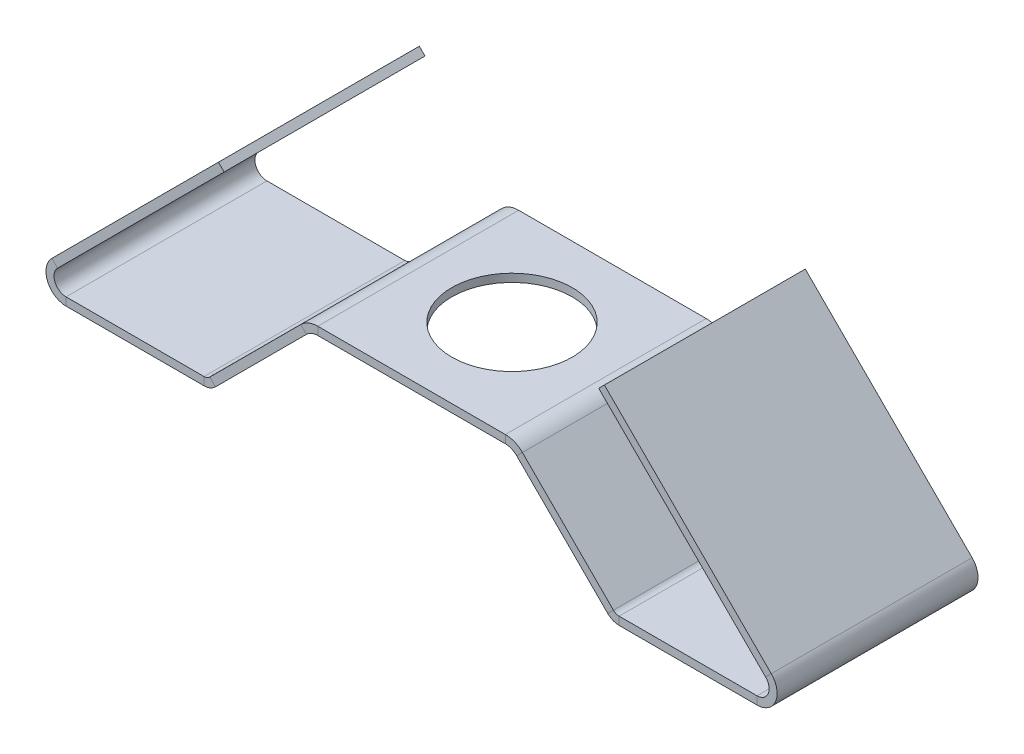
ISO-10303-21;
HEADER;
FILE_DESCRIPTION(('STEP AP214'),'2;1');
FILE_NAME('part.step','',(''),(''),'','','');
FILE_SCHEMA(('AUTOMOTIVE_DESIGN { 1 0 10303 214 1 1 1 1 }'));
ENDSEC;
DATA;
#1=APPLICATION_CONTEXT('core data for automotive mechanical design processes');
#2=APPLICATION_PROTOCOL_DEFINITION('international standard','automotive_design',2000,#1);
#3=PRODUCT_CONTEXT('',#1,'mechanical');
#4=PRODUCT('Part','Part','',(#3));
#5=PRODUCT_RELATED_PRODUCT_CATEGORY('part','',(#4));
#6=PRODUCT_DEFINITION_FORMATION('','',#4);
#7=PRODUCT_DEFINITION_CONTEXT('part definition',#1,'design');
#8=PRODUCT_DEFINITION('design','',#6,#7);
#9=PRODUCT_DEFINITION_SHAPE('','',#8);
#10=(LENGTH_UNIT() NAMED_UNIT(*) SI_UNIT(.MILLI.,.METRE.));
#11=(NAMED_UNIT(*) PLANE_ANGLE_UNIT() SI_UNIT($,.RADIAN.));
#12=(NAMED_UNIT(*) SI_UNIT($,.STERADIAN.) SOLID_ANGLE_UNIT());
#13=UNCERTAINTY_MEASURE_WITH_UNIT(LENGTH_MEASURE(1.E-05),#10,'distance_accuracy_value','');
#14=(GEOMETRIC_REPRESENTATION_CONTEXT(3) GLOBAL_UNCERTAINTY_ASSIGNED_CONTEXT((#13)) GLOBAL_UNIT_ASSIGNED_CONTEXT((#10,
#11,#12)) REPRESENTATION_CONTEXT('',''));
#15=CARTESIAN_POINT('',(0.,0.,0.));
#16=DIRECTION('',(0.,0.,1.));
#17=DIRECTION('',(1.,0.,0.));
#18=AXIS2_PLACEMENT_3D('',#15,#16,#17);
#19=CARTESIAN_POINT('',(0.0964466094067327,0.0964466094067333,0.));
#20=DIRECTION('',(0.707106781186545,0.70710678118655,0.));
#21=DIRECTION('',(-0.70710678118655,0.707106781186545,0.));
#22=AXIS2_PLACEMENT_3D('',#19,#20,#21);
#23=PLANE('',#22);
#24=DIRECTION('',(0.,0.,-1.));
#25=VECTOR('',#24,1.);
#26=CARTESIAN_POINT('',(-4.80710678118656,5.,-2.5));
#27=LINE('',#26,#25);
#28=CARTESIAN_POINT('',(-4.80710678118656,5.,2.5));
#29=VERTEX_POINT('',#28);
#30=CARTESIAN_POINT('',(-4.80710678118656,5.,-2.5));
#31=VERTEX_POINT('',#30);
#32=EDGE_CURVE('E260',#29,#31,#27,.T.);
#33=ORIENTED_EDGE('',*,*,#32,.F.);
#34=DIRECTION('',(-0.70710678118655,0.707106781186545,0.));
#35=VECTOR('',#34,1.);
#36=CARTESIAN_POINT('',(-4.80710678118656,5.,2.5));
#37=LINE('',#36,#35);
#38=CARTESIAN_POINT('',(-4.66568542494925,4.85857864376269,2.5));
#39=VERTEX_POINT('',#38);
#40=EDGE_CURVE('E246',#39,#29,#37,.T.);
#41=ORIENTED_EDGE('',*,*,#40,.F.);
#42=DIRECTION('',(0.,0.,1.));
#43=VECTOR('',#42,1.);
#44=CARTESIAN_POINT('',(-4.66568542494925,4.85857864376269,-2.5));
#45=LINE('',#44,#43);
#46=CARTESIAN_POINT('',(-4.66568542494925,4.85857864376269,-2.5));
#47=VERTEX_POINT('',#46);
#48=EDGE_CURVE('E241',#47,#39,#45,.T.);
#49=ORIENTED_EDGE('',*,*,#48,.F.);
#50=DIRECTION('',(0.70710678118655,-0.707106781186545,0.));
#51=VECTOR('',#50,1.);
#52=CARTESIAN_POINT('',(-4.80710678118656,5.,-2.5));
#53=LINE('',#52,#51);
#54=EDGE_CURVE('E243',#31,#47,#53,.T.);
#55=ORIENTED_EDGE('',*,*,#54,.F.);
#56=EDGE_LOOP('',(#33,#41,#49,#55));
#57=FACE_BOUND('',#56,.T.);
#58=ADVANCED_FACE('F36',(#57),#23,.T.);
#59=CARTESIAN_POINT('',(-0.0993528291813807,0.0922496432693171,0.));
#60=DIRECTION('',(0.707711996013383,-0.706501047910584,0.));
#61=DIRECTION('',(0.706501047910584,0.707711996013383,0.));
#62=AXIS2_PLACEMENT_3D('',#59,#60,#61);
#63=PLANE('',#62);
#64=DIRECTION('',(0.,0.,-1.));
#65=VECTOR('',#64,1.);
#66=CARTESIAN_POINT('',(4.8,5.,-2.5));
#67=LINE('',#66,#65);
#68=CARTESIAN_POINT('',(4.8,5.,2.5));
#69=VERTEX_POINT('',#68);
#70=CARTESIAN_POINT('',(4.8,5.,-2.5));
#71=VERTEX_POINT('',#70);
#72=EDGE_CURVE('E50',#69,#71,#67,.T.);
#73=ORIENTED_EDGE('',*,*,#72,.T.);
#74=DIRECTION('',(-0.706501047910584,-0.707711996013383,0.));
#75=VECTOR('',#74,1.);
#76=CARTESIAN_POINT('',(4.8,5.,-2.5));
#77=LINE('',#76,#75);
#78=CARTESIAN_POINT('',(4.65869979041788,4.85845760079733,-2.5));
#79=VERTEX_POINT('',#78);
#80=EDGE_CURVE('E11',#71,#79,#77,.T.);
#81=ORIENTED_EDGE('',*,*,#80,.T.);
#82=DIRECTION('',(0.,0.,1.));
#83=VECTOR('',#82,1.);
#84=CARTESIAN_POINT('',(4.65869979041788,4.85845760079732,-2.5));
#85=LINE('',#84,#83);
#86=CARTESIAN_POINT('',(4.65869979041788,4.85845760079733,2.5));
#87=VERTEX_POINT('',#86);
#88=EDGE_CURVE('E390',#79,#87,#85,.T.);
#89=ORIENTED_EDGE('',*,*,#88,.T.);
#90=DIRECTION('',(0.706501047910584,0.707711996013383,0.));
#91=VECTOR('',#90,1.);
#92=CARTESIAN_POINT('',(4.8,5.,2.5));
#93=LINE('',#92,#91);
#94=EDGE_CURVE('E56',#87,#69,#93,.T.);
#95=ORIENTED_EDGE('',*,*,#94,.T.);
#96=EDGE_LOOP('',(#73,#81,#89,#95));
#97=FACE_BOUND('',#96,.T.);
#98=ADVANCED_FACE('F658',(#97),#63,.F.);
#99=CARTESIAN_POINT('',(-4.66568542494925,4.85857864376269,-2.5));
#100=DIRECTION('',(0.707106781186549,-0.707106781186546,0.));
#101=DIRECTION('',(0.707106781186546,0.707106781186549,0.));
#102=AXIS2_PLACEMENT_3D('',#99,#100,#101);
#103=PLANE('',#102);
#104=DIRECTION('',(-0.707106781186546,-0.707106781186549,0.));
#105=VECTOR('',#104,1.);
#106=CARTESIAN_POINT('',(-4.66568542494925,4.85857864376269,2.5));
#107=LINE('',#106,#105);
#108=CARTESIAN_POINT('',(-8.81213203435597,0.712132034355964,2.5));
#109=VERTEX_POINT('',#108);
#110=EDGE_CURVE('E267',#39,#109,#107,.T.);
#111=ORIENTED_EDGE('',*,*,#110,.T.);
#112=DIRECTION('',(0.,0.,1.));
#113=VECTOR('',#112,1.);
#114=CARTESIAN_POINT('',(-8.81213203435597,0.712132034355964,-2.5));
#115=LINE('',#114,#113);
#116=CARTESIAN_POINT('',(-8.81213203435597,0.712132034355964,-2.5));
#117=VERTEX_POINT('',#116);
#118=EDGE_CURVE('E265',#117,#109,#115,.T.);
#119=ORIENTED_EDGE('',*,*,#118,.F.);
#120=DIRECTION('',(-0.707106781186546,-0.707106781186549,0.));
#121=VECTOR('',#120,1.);
#122=CARTESIAN_POINT('',(-4.66568542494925,4.85857864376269,-2.5));
#123=LINE('',#122,#121);
#124=EDGE_CURVE('E257',#47,#117,#123,.T.);
#125=ORIENTED_EDGE('',*,*,#124,.F.);
#126=ORIENTED_EDGE('',*,*,#48,.T.);
#127=EDGE_LOOP('',(#111,#119,#125,#126));
#128=FACE_BOUND('',#127,.T.);
#129=ADVANCED_FACE('F263',(#128),#103,.T.);
#130=CARTESIAN_POINT('',(-4.80710678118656,5.,2.5));
#131=DIRECTION('',(0.,0.,1.));
#132=DIRECTION('',(1.,0.,0.));
#133=AXIS2_PLACEMENT_3D('',#130,#131,#132);
#134=PLANE('',#133);
#135=DIRECTION('',(-0.707106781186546,-0.707106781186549,0.));
#136=VECTOR('',#135,1.);
#137=CARTESIAN_POINT('',(-4.80710678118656,5.,2.5));
#138=LINE('',#137,#136);
#139=CARTESIAN_POINT('',(-8.95355339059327,0.853553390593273,2.5));
#140=VERTEX_POINT('',#139);
#141=EDGE_CURVE('E401',#29,#140,#138,.T.);
#142=ORIENTED_EDGE('',*,*,#141,.T.);
#143=DIRECTION('',(-0.70710678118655,0.707106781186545,0.));
#144=VECTOR('',#143,1.);
#145=CARTESIAN_POINT('',(-8.95355339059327,0.853553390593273,2.5));
#146=LINE('',#145,#144);
#147=EDGE_CURVE('E398',#109,#140,#146,.T.);
#148=ORIENTED_EDGE('',*,*,#147,.F.);
#149=ORIENTED_EDGE('',*,*,#110,.F.);
#150=ORIENTED_EDGE('',*,*,#40,.T.);
#151=EDGE_LOOP('',(#142,#148,#149,#150));
#152=FACE_BOUND('',#151,.T.);
#153=ADVANCED_FACE('F714',(#152),#134,.T.);
#154=CARTESIAN_POINT('',(-4.80710678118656,5.,-2.5));
#155=DIRECTION('',(-0.707106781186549,0.707106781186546,0.));
#156=DIRECTION('',(-0.707106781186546,-0.707106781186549,0.));
#157=AXIS2_PLACEMENT_3D('',#154,#155,#156);
#158=PLANE('',#157);
#159=DIRECTION('',(-0.707106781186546,-0.707106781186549,0.));
#160=VECTOR('',#159,1.);
#161=CARTESIAN_POINT('',(-4.80710678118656,5.,-2.5));
#162=LINE('',#161,#160);
#163=CARTESIAN_POINT('',(-8.95355339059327,0.853553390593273,-2.5));
#164=VERTEX_POINT('',#163);
#165=EDGE_CURVE('E259',#31,#164,#162,.T.);
#166=ORIENTED_EDGE('',*,*,#165,.T.);
#167=DIRECTION('',(0.,0.,-1.));
#168=VECTOR('',#167,1.);
#169=CARTESIAN_POINT('',(-8.95355339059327,0.853553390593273,-2.5));
#170=LINE('',#169,#168);
#171=EDGE_CURVE('E404',#140,#164,#170,.T.);
#172=ORIENTED_EDGE('',*,*,#171,.F.);
#173=ORIENTED_EDGE('',*,*,#141,.F.);
#174=ORIENTED_EDGE('',*,*,#32,.T.);
#175=EDGE_LOOP('',(#166,#172,#173,#174));
#176=FACE_BOUND('',#175,.T.);
#177=ADVANCED_FACE('F619',(#176),#158,.T.);
#178=CARTESIAN_POINT('',(-4.80710678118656,5.,-2.5));
#179=DIRECTION('',(0.,0.,-1.));
#180=DIRECTION('',(-1.,0.,0.));
#181=AXIS2_PLACEMENT_3D('',#178,#179,#180);
#182=PLANE('',#181);
#183=DIRECTION('',(0.70710678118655,-0.707106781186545,0.));
#184=VECTOR('',#183,1.);
#185=CARTESIAN_POINT('',(-8.95355339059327,0.853553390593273,-2.5));
#186=LINE('',#185,#184);
#187=EDGE_CURVE('E281',#164,#117,#186,.T.);
#188=ORIENTED_EDGE('',*,*,#187,.F.);
#189=ORIENTED_EDGE('',*,*,#165,.F.);
#190=ORIENTED_EDGE('',*,*,#54,.T.);
#191=ORIENTED_EDGE('',*,*,#124,.T.);
#192=EDGE_LOOP('',(#188,#189,#190,#191));
#193=FACE_BOUND('',#192,.T.);
#194=ADVANCED_FACE('F256',(#193),#182,.T.);
#195=CARTESIAN_POINT('',(-8.6,0.5,0.));
#196=DIRECTION('',(0.,0.,1.));
#197=DIRECTION('',(1.,0.,0.));
#198=AXIS2_PLACEMENT_3D('',#195,#196,#197);
#199=CYLINDRICAL_SURFACE('',#198,0.300000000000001);
#200=CARTESIAN_POINT('',(-8.6,0.5,2.5));
#201=DIRECTION('',(0.,0.,1.));
#202=DIRECTION('',(-0.707106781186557,0.707106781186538,0.));
#203=AXIS2_PLACEMENT_3D('',#200,#201,#202);
#204=CIRCLE('',#203,0.300000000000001);
#205=CARTESIAN_POINT('',(-8.6,0.199999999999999,2.5));
#206=VERTEX_POINT('',#205);
#207=EDGE_CURVE('E274',#109,#206,#204,.T.);
#208=ORIENTED_EDGE('',*,*,#207,.T.);
#209=DIRECTION('',(0.,0.,1.));
#210=VECTOR('',#209,1.);
#211=CARTESIAN_POINT('',(-8.6,0.2,-2.5));
#212=LINE('',#211,#210);
#213=CARTESIAN_POINT('',(-8.6,0.199999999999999,-2.5));
#214=VERTEX_POINT('',#213);
#215=EDGE_CURVE('E271',#214,#206,#212,.T.);
#216=ORIENTED_EDGE('',*,*,#215,.F.);
#217=CARTESIAN_POINT('',(-8.6,0.5,-2.5));
#218=DIRECTION('',(0.,0.,1.));
#219=DIRECTION('',(-0.707106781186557,0.707106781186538,0.));
#220=AXIS2_PLACEMENT_3D('',#217,#218,#219);
#221=CIRCLE('',#220,0.300000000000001);
#222=EDGE_CURVE('E275',#117,#214,#221,.T.);
#223=ORIENTED_EDGE('',*,*,#222,.F.);
#224=ORIENTED_EDGE('',*,*,#118,.T.);
#225=EDGE_LOOP('',(#208,#216,#223,#224));
#226=FACE_BOUND('',#225,.T.);
#227=ADVANCED_FACE('F615',(#226),#199,.F.);
#228=CARTESIAN_POINT('',(-8.95355339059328,0.853553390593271,2.5));
#229=DIRECTION('',(0.,0.,1.));
#230=DIRECTION('',(1.,0.,0.));
#231=AXIS2_PLACEMENT_3D('',#228,#229,#230);
#232=PLANE('',#231);
#233=CARTESIAN_POINT('',(-8.6,0.5,2.5));
#234=DIRECTION('',(0.,0.,1.));
#235=DIRECTION('',(-0.707106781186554,0.707106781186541,0.));
#236=AXIS2_PLACEMENT_3D('',#233,#234,#235);
#237=CIRCLE('',#236,0.500000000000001);
#238=CARTESIAN_POINT('',(-8.6,0.,2.5));
#239=VERTEX_POINT('',#238);
#240=EDGE_CURVE('E407',#140,#239,#237,.T.);
#241=ORIENTED_EDGE('',*,*,#240,.T.);
#242=DIRECTION('',(0.,-1.,0.));
#243=VECTOR('',#242,1.);
#244=CARTESIAN_POINT('',(-8.6,0.,2.5));
#245=LINE('',#244,#243);
#246=EDGE_CURVE('E278',#206,#239,#245,.T.);
#247=ORIENTED_EDGE('',*,*,#246,.F.);
#248=ORIENTED_EDGE('',*,*,#207,.F.);
#249=ORIENTED_EDGE('',*,*,#147,.T.);
#250=EDGE_LOOP('',(#241,#247,#248,#249));
#251=FACE_BOUND('',#250,.T.);
#252=ADVANCED_FACE('F626',(#251),#232,.T.);
#253=CARTESIAN_POINT('',(-8.6,0.5,0.));
#254=DIRECTION('',(0.,0.,1.));
#255=DIRECTION('',(1.,0.,0.));
#256=AXIS2_PLACEMENT_3D('',#253,#254,#255);
#257=CYLINDRICAL_SURFACE('',#256,0.500000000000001);
#258=CARTESIAN_POINT('',(-8.6,0.5,-2.5));
#259=DIRECTION('',(0.,0.,1.));
#260=DIRECTION('',(-0.707106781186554,0.707106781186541,0.));
#261=AXIS2_PLACEMENT_3D('',#258,#259,#260);
#262=CIRCLE('',#261,0.500000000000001);
#263=CARTESIAN_POINT('',(-8.6,0.,-2.5));
#264=VERTEX_POINT('',#263);
#265=EDGE_CURVE('E475',#164,#264,#262,.T.);
#266=ORIENTED_EDGE('',*,*,#265,.T.);
#267=DIRECTION('',(0.,0.,-1.));
#268=VECTOR('',#267,1.);
#269=CARTESIAN_POINT('',(-8.6,0.,-2.5));
#270=LINE('',#269,#268);
#271=EDGE_CURVE('E410',#239,#264,#270,.T.);
#272=ORIENTED_EDGE('',*,*,#271,.F.);
#273=ORIENTED_EDGE('',*,*,#240,.F.);
#274=ORIENTED_EDGE('',*,*,#171,.T.);
#275=EDGE_LOOP('',(#266,#272,#273,#274));
#276=FACE_BOUND('',#275,.T.);
#277=ADVANCED_FACE('F622',(#276),#257,.T.);
#278=CARTESIAN_POINT('',(-8.95355339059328,0.853553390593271,-2.5));
#279=DIRECTION('',(0.,0.,-1.));
#280=DIRECTION('',(-1.,0.,0.));
#281=AXIS2_PLACEMENT_3D('',#278,#279,#280);
#282=PLANE('',#281);
#283=DIRECTION('',(0.,1.,0.));
#284=VECTOR('',#283,1.);
#285=CARTESIAN_POINT('',(-8.6,0.,-2.5));
#286=LINE('',#285,#284);
#287=EDGE_CURVE('E292',#264,#214,#286,.T.);
#288=ORIENTED_EDGE('',*,*,#287,.F.);
#289=ORIENTED_EDGE('',*,*,#265,.F.);
#290=ORIENTED_EDGE('',*,*,#187,.T.);
#291=ORIENTED_EDGE('',*,*,#222,.T.);
#292=EDGE_LOOP('',(#288,#289,#290,#291));
#293=FACE_BOUND('',#292,.T.);
#294=ADVANCED_FACE('F616',(#293),#282,.T.);
#295=CARTESIAN_POINT('',(-8.6,0.2,-2.5));
#296=DIRECTION('',(0.,1.,0.));
#297=DIRECTION('',(-1.,0.,0.));
#298=AXIS2_PLACEMENT_3D('',#295,#296,#297);
#299=PLANE('',#298);
#300=DIRECTION('',(1.,0.,0.));
#301=VECTOR('',#300,1.);
#302=CARTESIAN_POINT('',(-8.6,0.2,2.5));
#303=LINE('',#302,#301);
#304=CARTESIAN_POINT('',(-5.16568542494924,0.2,2.5));
#305=VERTEX_POINT('',#304);
#306=EDGE_CURVE('E285',#206,#305,#303,.T.);
#307=ORIENTED_EDGE('',*,*,#306,.T.);
#308=DIRECTION('',(0.,0.,1.));
#309=VECTOR('',#308,1.);
#310=CARTESIAN_POINT('',(-5.16568542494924,0.2,-2.5));
#311=LINE('',#310,#309);
#312=CARTESIAN_POINT('',(-5.16568542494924,0.2,-2.5));
#313=VERTEX_POINT('',#312);
#314=EDGE_CURVE('E282',#313,#305,#311,.T.);
#315=ORIENTED_EDGE('',*,*,#314,.F.);
#316=DIRECTION('',(1.,0.,0.));
#317=VECTOR('',#316,1.);
#318=CARTESIAN_POINT('',(-8.6,0.2,-2.5));
#319=LINE('',#318,#317);
#320=EDGE_CURVE('E286',#214,#313,#319,.T.);
#321=ORIENTED_EDGE('',*,*,#320,.F.);
#322=ORIENTED_EDGE('',*,*,#215,.T.);
#323=EDGE_LOOP('',(#307,#315,#321,#322));
#324=FACE_BOUND('',#323,.T.);
#325=ADVANCED_FACE('F609',(#324),#299,.T.);
#326=CARTESIAN_POINT('',(-8.6,0.,2.5));
#327=DIRECTION('',(0.,0.,1.));
#328=DIRECTION('',(1.,0.,0.));
#329=AXIS2_PLACEMENT_3D('',#326,#327,#328);
#330=PLANE('',#329);
#331=DIRECTION('',(1.,0.,0.));
#332=VECTOR('',#331,1.);
#333=CARTESIAN_POINT('',(-8.6,0.,2.5));
#334=LINE('',#333,#332);
#335=CARTESIAN_POINT('',(-5.16568542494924,0.,2.5));
#336=VERTEX_POINT('',#335);
#337=EDGE_CURVE('E413',#239,#336,#334,.T.);
#338=ORIENTED_EDGE('',*,*,#337,.T.);
#339=DIRECTION('',(0.,-1.,0.));
#340=VECTOR('',#339,1.);
#341=CARTESIAN_POINT('',(-5.16568542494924,0.,2.5));
#342=LINE('',#341,#340);
#343=EDGE_CURVE('E289',#305,#336,#342,.T.);
#344=ORIENTED_EDGE('',*,*,#343,.F.);
#345=ORIENTED_EDGE('',*,*,#306,.F.);
#346=ORIENTED_EDGE('',*,*,#246,.T.);
#347=EDGE_LOOP('',(#338,#344,#345,#346));
#348=FACE_BOUND('',#347,.T.);
#349=ADVANCED_FACE('F629',(#348),#330,.T.);
#350=CARTESIAN_POINT('',(-8.6,0.,-2.5));
#351=DIRECTION('',(0.,-1.,0.));
#352=DIRECTION('',(1.,0.,0.));
#353=AXIS2_PLACEMENT_3D('',#350,#351,#352);
#354=PLANE('',#353);
#355=DIRECTION('',(1.,0.,0.));
#356=VECTOR('',#355,1.);
#357=CARTESIAN_POINT('',(-8.6,0.,-2.5));
#358=LINE('',#357,#356);
#359=CARTESIAN_POINT('',(-5.16568542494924,0.,-2.5));
#360=VERTEX_POINT('',#359);
#361=EDGE_CURVE('E480',#264,#360,#358,.T.);
#362=ORIENTED_EDGE('',*,*,#361,.T.);
#363=DIRECTION('',(0.,0.,-1.));
#364=VECTOR('',#363,1.);
#365=CARTESIAN_POINT('',(-5.16568542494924,0.,-2.5));
#366=LINE('',#365,#364);
#367=EDGE_CURVE('E416',#336,#360,#366,.T.);
#368=ORIENTED_EDGE('',*,*,#367,.F.);
#369=ORIENTED_EDGE('',*,*,#337,.F.);
#370=ORIENTED_EDGE('',*,*,#271,.T.);
#371=EDGE_LOOP('',(#362,#368,#369,#370));
#372=FACE_BOUND('',#371,.T.);
#373=ADVANCED_FACE('F686',(#372),#354,.T.);
#374=CARTESIAN_POINT('',(-8.6,0.,-2.5));
#375=DIRECTION('',(0.,0.,-1.));
#376=DIRECTION('',(-1.,0.,0.));
#377=AXIS2_PLACEMENT_3D('',#374,#375,#376);
#378=PLANE('',#377);
#379=DIRECTION('',(0.,1.,0.));
#380=VECTOR('',#379,1.);
#381=CARTESIAN_POINT('',(-5.16568542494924,0.,-2.5));
#382=LINE('',#381,#380);
#383=EDGE_CURVE('E303',#360,#313,#382,.T.);
#384=ORIENTED_EDGE('',*,*,#383,.F.);
#385=ORIENTED_EDGE('',*,*,#361,.F.);
#386=ORIENTED_EDGE('',*,*,#287,.T.);
#387=ORIENTED_EDGE('',*,*,#320,.T.);
#388=EDGE_LOOP('',(#384,#385,#386,#387));
#389=FACE_BOUND('',#388,.T.);
#390=ADVANCED_FACE('F610',(#389),#378,.T.);
#391=CARTESIAN_POINT('',(-5.16568542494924,0.4,0.));
#392=DIRECTION('',(0.,0.,1.));
#393=DIRECTION('',(1.,0.,0.));
#394=AXIS2_PLACEMENT_3D('',#391,#392,#393);
#395=CYLINDRICAL_SURFACE('',#394,0.2);
#396=CARTESIAN_POINT('',(-5.16568542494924,0.4,2.5));
#397=DIRECTION('',(0.,0.,1.));
#398=DIRECTION('',(0.,-1.,0.));
#399=AXIS2_PLACEMENT_3D('',#396,#397,#398);
#400=CIRCLE('',#399,0.2);
#401=CARTESIAN_POINT('',(-5.02426406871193,0.258578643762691,2.5));
#402=VERTEX_POINT('',#401);
#403=EDGE_CURVE('E296',#305,#402,#400,.T.);
#404=ORIENTED_EDGE('',*,*,#403,.T.);
#405=DIRECTION('',(0.,0.,1.));
#406=VECTOR('',#405,1.);
#407=CARTESIAN_POINT('',(-5.02426406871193,0.25857864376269,-2.5));
#408=LINE('',#407,#406);
#409=CARTESIAN_POINT('',(-5.02426406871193,0.258578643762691,-2.5));
#410=VERTEX_POINT('',#409);
#411=EDGE_CURVE('E293',#410,#402,#408,.T.);
#412=ORIENTED_EDGE('',*,*,#411,.F.);
#413=CARTESIAN_POINT('',(-5.16568542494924,0.4,-2.5));
#414=DIRECTION('',(0.,0.,1.));
#415=DIRECTION('',(0.,-1.,0.));
#416=AXIS2_PLACEMENT_3D('',#413,#414,#415);
#417=CIRCLE('',#416,0.2);
#418=EDGE_CURVE('E297',#313,#410,#417,.T.);
#419=ORIENTED_EDGE('',*,*,#418,.F.);
#420=ORIENTED_EDGE('',*,*,#314,.T.);
#421=EDGE_LOOP('',(#404,#412,#419,#420));
#422=FACE_BOUND('',#421,.T.);
#423=ADVANCED_FACE('F603',(#422),#395,.F.);
#424=CARTESIAN_POINT('',(-5.16568542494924,0.,2.5));
#425=DIRECTION('',(0.,0.,1.));
#426=DIRECTION('',(1.,0.,0.));
#427=AXIS2_PLACEMENT_3D('',#424,#425,#426);
#428=PLANE('',#427);
#429=CARTESIAN_POINT('',(-5.16568542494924,0.4,2.5));
#430=DIRECTION('',(0.,0.,1.));
#431=DIRECTION('',(0.,-1.,0.));
#432=AXIS2_PLACEMENT_3D('',#429,#430,#431);
#433=CIRCLE('',#432,0.4);
#434=CARTESIAN_POINT('',(-4.88284271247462,0.117157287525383,2.5));
#435=VERTEX_POINT('',#434);
#436=EDGE_CURVE('E419',#336,#435,#433,.T.);
#437=ORIENTED_EDGE('',*,*,#436,.T.);
#438=DIRECTION('',(0.707106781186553,-0.707106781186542,0.));
#439=VECTOR('',#438,1.);
#440=CARTESIAN_POINT('',(-4.88284271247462,0.117157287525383,2.5));
#441=LINE('',#440,#439);
#442=EDGE_CURVE('E300',#402,#435,#441,.T.);
#443=ORIENTED_EDGE('',*,*,#442,.F.);
#444=ORIENTED_EDGE('',*,*,#403,.F.);
#445=ORIENTED_EDGE('',*,*,#343,.T.);
#446=EDGE_LOOP('',(#437,#443,#444,#445));
#447=FACE_BOUND('',#446,.T.);
#448=ADVANCED_FACE('F632',(#447),#428,.T.);
#449=CARTESIAN_POINT('',(-5.16568542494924,0.4,0.));
#450=DIRECTION('',(0.,0.,1.));
#451=DIRECTION('',(1.,0.,0.));
#452=AXIS2_PLACEMENT_3D('',#449,#450,#451);
#453=CYLINDRICAL_SURFACE('',#452,0.4);
#454=CARTESIAN_POINT('',(-5.16568542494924,0.4,-2.5));
#455=DIRECTION('',(0.,0.,1.));
#456=DIRECTION('',(0.,-1.,0.));
#457=AXIS2_PLACEMENT_3D('',#454,#455,#456);
#458=CIRCLE('',#457,0.4);
#459=CARTESIAN_POINT('',(-4.88284271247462,0.117157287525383,-2.5));
#460=VERTEX_POINT('',#459);
#461=EDGE_CURVE('E485',#360,#460,#458,.T.);
#462=ORIENTED_EDGE('',*,*,#461,.T.);
#463=DIRECTION('',(0.,0.,-1.));
#464=VECTOR('',#463,1.);
#465=CARTESIAN_POINT('',(-4.88284271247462,0.117157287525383,-2.5));
#466=LINE('',#465,#464);
#467=EDGE_CURVE('E422',#435,#460,#466,.T.);
#468=ORIENTED_EDGE('',*,*,#467,.F.);
#469=ORIENTED_EDGE('',*,*,#436,.F.);
#470=ORIENTED_EDGE('',*,*,#367,.T.);
#471=EDGE_LOOP('',(#462,#468,#469,#470));
#472=FACE_BOUND('',#471,.T.);
#473=ADVANCED_FACE('F683',(#472),#453,.T.);
#474=CARTESIAN_POINT('',(-5.16568542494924,0.,-2.5));
#475=DIRECTION('',(0.,0.,-1.));
#476=DIRECTION('',(-1.,0.,0.));
#477=AXIS2_PLACEMENT_3D('',#474,#475,#476);
#478=PLANE('',#477);
#479=DIRECTION('',(-0.707106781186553,0.707106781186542,0.));
#480=VECTOR('',#479,1.);
#481=CARTESIAN_POINT('',(-4.88284271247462,0.117157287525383,-2.5));
#482=LINE('',#481,#480);
#483=EDGE_CURVE('E314',#460,#410,#482,.T.);
#484=ORIENTED_EDGE('',*,*,#483,.F.);
#485=ORIENTED_EDGE('',*,*,#461,.F.);
#486=ORIENTED_EDGE('',*,*,#383,.T.);
#487=ORIENTED_EDGE('',*,*,#418,.T.);
#488=EDGE_LOOP('',(#484,#485,#486,#487));
#489=FACE_BOUND('',#488,.T.);
#490=ADVANCED_FACE('F604',(#489),#478,.T.);
#491=CARTESIAN_POINT('',(-5.02426406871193,0.258578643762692,-2.5));
#492=DIRECTION('',(-0.707106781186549,0.707106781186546,0.));
#493=DIRECTION('',(-0.707106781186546,-0.707106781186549,0.));
#494=AXIS2_PLACEMENT_3D('',#491,#492,#493);
#495=PLANE('',#494);
#496=DIRECTION('',(0.707106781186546,0.707106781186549,0.));
#497=VECTOR('',#496,1.);
#498=CARTESIAN_POINT('',(-5.02426406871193,0.258578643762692,2.5));
#499=LINE('',#498,#497);
#500=CARTESIAN_POINT('',(-2.75857864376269,2.52426406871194,2.5));
#501=VERTEX_POINT('',#500);
#502=EDGE_CURVE('E307',#402,#501,#499,.T.);
#503=ORIENTED_EDGE('',*,*,#502,.T.);
#504=DIRECTION('',(0.,0.,1.));
#505=VECTOR('',#504,1.);
#506=CARTESIAN_POINT('',(-2.75857864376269,2.52426406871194,-2.5));
#507=LINE('',#506,#505);
#508=CARTESIAN_POINT('',(-2.75857864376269,2.52426406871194,-2.5));
#509=VERTEX_POINT('',#508);
#510=EDGE_CURVE('E304',#509,#501,#507,.T.);
#511=ORIENTED_EDGE('',*,*,#510,.F.);
#512=DIRECTION('',(0.707106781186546,0.707106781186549,0.));
#513=VECTOR('',#512,1.);
#514=CARTESIAN_POINT('',(-5.02426406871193,0.258578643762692,-2.5));
#515=LINE('',#514,#513);
#516=EDGE_CURVE('E308',#410,#509,#515,.T.);
#517=ORIENTED_EDGE('',*,*,#516,.F.);
#518=ORIENTED_EDGE('',*,*,#411,.T.);
#519=EDGE_LOOP('',(#503,#511,#517,#518));
#520=FACE_BOUND('',#519,.T.);
#521=ADVANCED_FACE('F597',(#520),#495,.T.);
#522=CARTESIAN_POINT('',(-4.88284271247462,0.117157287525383,2.5));
#523=DIRECTION('',(0.,0.,1.));
#524=DIRECTION('',(1.,0.,0.));
#525=AXIS2_PLACEMENT_3D('',#522,#523,#524);
#526=PLANE('',#525);
#527=DIRECTION('',(0.707106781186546,0.707106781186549,0.));
#528=VECTOR('',#527,1.);
#529=CARTESIAN_POINT('',(-4.88284271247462,0.117157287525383,2.5));
#530=LINE('',#529,#528);
#531=CARTESIAN_POINT('',(-2.61715728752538,2.38284271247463,2.5));
#532=VERTEX_POINT('',#531);
#533=EDGE_CURVE('E425',#435,#532,#530,.T.);
#534=ORIENTED_EDGE('',*,*,#533,.T.);
#535=DIRECTION('',(0.707106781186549,-0.707106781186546,0.));
#536=VECTOR('',#535,1.);
#537=CARTESIAN_POINT('',(-2.61715728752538,2.38284271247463,2.5));
#538=LINE('',#537,#536);
#539=EDGE_CURVE('E311',#501,#532,#538,.T.);
#540=ORIENTED_EDGE('',*,*,#539,.F.);
#541=ORIENTED_EDGE('',*,*,#502,.F.);
#542=ORIENTED_EDGE('',*,*,#442,.T.);
#543=EDGE_LOOP('',(#534,#540,#541,#542));
#544=FACE_BOUND('',#543,.T.);
#545=ADVANCED_FACE('F635',(#544),#526,.T.);
#546=CARTESIAN_POINT('',(-4.88284271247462,0.117157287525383,-2.5));
#547=DIRECTION('',(0.707106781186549,-0.707106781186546,0.));
#548=DIRECTION('',(0.707106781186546,0.707106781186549,0.));
#549=AXIS2_PLACEMENT_3D('',#546,#547,#548);
#550=PLANE('',#549);
#551=DIRECTION('',(0.707106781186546,0.707106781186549,0.));
#552=VECTOR('',#551,1.);
#553=CARTESIAN_POINT('',(-4.88284271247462,0.117157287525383,-2.5));
#554=LINE('',#553,#552);
#555=CARTESIAN_POINT('',(-2.61715728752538,2.38284271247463,-2.5));
#556=VERTEX_POINT('',#555);
#557=EDGE_CURVE('E490',#460,#556,#554,.T.);
#558=ORIENTED_EDGE('',*,*,#557,.T.);
#559=DIRECTION('',(0.,0.,-1.));
#560=VECTOR('',#559,1.);
#561=CARTESIAN_POINT('',(-2.61715728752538,2.38284271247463,-2.5));
#562=LINE('',#561,#560);
#563=EDGE_CURVE('E428',#532,#556,#562,.T.);
#564=ORIENTED_EDGE('',*,*,#563,.F.);
#565=ORIENTED_EDGE('',*,*,#533,.F.);
#566=ORIENTED_EDGE('',*,*,#467,.T.);
#567=EDGE_LOOP('',(#558,#564,#565,#566));
#568=FACE_BOUND('',#567,.T.);
#569=ADVANCED_FACE('F680',(#568),#550,.T.);
#570=CARTESIAN_POINT('',(-4.88284271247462,0.117157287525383,-2.5));
#571=DIRECTION('',(0.,0.,-1.));
#572=DIRECTION('',(-1.,0.,0.));
#573=AXIS2_PLACEMENT_3D('',#570,#571,#572);
#574=PLANE('',#573);
#575=DIRECTION('',(-0.707106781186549,0.707106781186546,0.));
#576=VECTOR('',#575,1.);
#577=CARTESIAN_POINT('',(-2.61715728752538,2.38284271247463,-2.5));
#578=LINE('',#577,#576);
#579=EDGE_CURVE('E325',#556,#509,#578,.T.);
#580=ORIENTED_EDGE('',*,*,#579,.F.);
#581=ORIENTED_EDGE('',*,*,#557,.F.);
#582=ORIENTED_EDGE('',*,*,#483,.T.);
#583=ORIENTED_EDGE('',*,*,#516,.T.);
#584=EDGE_LOOP('',(#580,#581,#582,#583));
#585=FACE_BOUND('',#584,.T.);
#586=ADVANCED_FACE('F598',(#585),#574,.T.);
#587=CARTESIAN_POINT('',(-2.33431457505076,2.10000000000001,0.));
#588=DIRECTION('',(0.,0.,-1.));
#589=DIRECTION('',(-1.,0.,0.));
#590=AXIS2_PLACEMENT_3D('',#587,#588,#589);
#591=CYLINDRICAL_SURFACE('',#590,0.600000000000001);
#592=CARTESIAN_POINT('',(-2.33431457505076,2.10000000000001,2.5));
#593=DIRECTION('',(0.,0.,-1.));
#594=DIRECTION('',(-0.707106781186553,0.707106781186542,0.));
#595=AXIS2_PLACEMENT_3D('',#592,#593,#594);
#596=CIRCLE('',#595,0.600000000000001);
#597=CARTESIAN_POINT('',(-2.33431457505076,2.70000000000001,2.5));
#598=VERTEX_POINT('',#597);
#599=EDGE_CURVE('E318',#501,#598,#596,.T.);
#600=ORIENTED_EDGE('',*,*,#599,.T.);
#601=DIRECTION('',(0.,0.,1.));
#602=VECTOR('',#601,1.);
#603=CARTESIAN_POINT('',(-2.33431457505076,2.70000000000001,-2.5));
#604=LINE('',#603,#602);
#605=CARTESIAN_POINT('',(-2.33431457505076,2.70000000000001,-2.5));
#606=VERTEX_POINT('',#605);
#607=EDGE_CURVE('E315',#606,#598,#604,.T.);
#608=ORIENTED_EDGE('',*,*,#607,.F.);
#609=CARTESIAN_POINT('',(-2.33431457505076,2.10000000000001,-2.5));
#610=DIRECTION('',(0.,0.,-1.));
#611=DIRECTION('',(-0.707106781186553,0.707106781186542,0.));
#612=AXIS2_PLACEMENT_3D('',#609,#610,#611);
#613=CIRCLE('',#612,0.600000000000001);
#614=EDGE_CURVE('E319',#509,#606,#613,.T.);
#615=ORIENTED_EDGE('',*,*,#614,.F.);
#616=ORIENTED_EDGE('',*,*,#510,.T.);
#617=EDGE_LOOP('',(#600,#608,#615,#616));
#618=FACE_BOUND('',#617,.T.);
#619=ADVANCED_FACE('F591',(#618),#591,.T.);
#620=CARTESIAN_POINT('',(-2.61715728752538,2.38284271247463,2.5));
#621=DIRECTION('',(0.,0.,1.));
#622=DIRECTION('',(1.,0.,0.));
#623=AXIS2_PLACEMENT_3D('',#620,#621,#622);
#624=PLANE('',#623);
#625=CARTESIAN_POINT('',(-2.33431457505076,2.10000000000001,2.5));
#626=DIRECTION('',(0.,0.,-1.));
#627=DIRECTION('',(-0.707106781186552,0.707106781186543,0.));
#628=AXIS2_PLACEMENT_3D('',#625,#626,#627);
#629=CIRCLE('',#628,0.400000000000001);
#630=CARTESIAN_POINT('',(-2.33431457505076,2.50000000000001,2.5));
#631=VERTEX_POINT('',#630);
#632=EDGE_CURVE('E431',#532,#631,#629,.T.);
#633=ORIENTED_EDGE('',*,*,#632,.T.);
#634=DIRECTION('',(0.,-1.,0.));
#635=VECTOR('',#634,1.);
#636=CARTESIAN_POINT('',(-2.33431457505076,2.50000000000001,2.5));
#637=LINE('',#636,#635);
#638=EDGE_CURVE('E322',#598,#631,#637,.T.);
#639=ORIENTED_EDGE('',*,*,#638,.F.);
#640=ORIENTED_EDGE('',*,*,#599,.F.);
#641=ORIENTED_EDGE('',*,*,#539,.T.);
#642=EDGE_LOOP('',(#633,#639,#640,#641));
#643=FACE_BOUND('',#642,.T.);
#644=ADVANCED_FACE('F638',(#643),#624,.T.);
#645=CARTESIAN_POINT('',(-2.33431457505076,2.10000000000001,0.));
#646=DIRECTION('',(0.,0.,-1.));
#647=DIRECTION('',(-1.,0.,0.));
#648=AXIS2_PLACEMENT_3D('',#645,#646,#647);
#649=CYLINDRICAL_SURFACE('',#648,0.400000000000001);
#650=CARTESIAN_POINT('',(-2.33431457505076,2.10000000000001,-2.5));
#651=DIRECTION('',(0.,0.,-1.));
#652=DIRECTION('',(-0.707106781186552,0.707106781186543,0.));
#653=AXIS2_PLACEMENT_3D('',#650,#651,#652);
#654=CIRCLE('',#653,0.400000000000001);
#655=CARTESIAN_POINT('',(-2.33431457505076,2.50000000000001,-2.5));
#656=VERTEX_POINT('',#655);
#657=EDGE_CURVE('E495',#556,#656,#654,.T.);
#658=ORIENTED_EDGE('',*,*,#657,.T.);
#659=DIRECTION('',(0.,0.,-1.));
#660=VECTOR('',#659,1.);
#661=CARTESIAN_POINT('',(-2.33431457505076,2.50000000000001,-2.5));
#662=LINE('',#661,#660);
#663=EDGE_CURVE('E434',#631,#656,#662,.T.);
#664=ORIENTED_EDGE('',*,*,#663,.F.);
#665=ORIENTED_EDGE('',*,*,#632,.F.);
#666=ORIENTED_EDGE('',*,*,#563,.T.);
#667=EDGE_LOOP('',(#658,#664,#665,#666));
#668=FACE_BOUND('',#667,.T.);
#669=ADVANCED_FACE('F677',(#668),#649,.F.);
#670=CARTESIAN_POINT('',(-2.61715728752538,2.38284271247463,-2.5));
#671=DIRECTION('',(0.,0.,-1.));
#672=DIRECTION('',(-1.,0.,0.));
#673=AXIS2_PLACEMENT_3D('',#670,#671,#672);
#674=PLANE('',#673);
#675=DIRECTION('',(0.,1.,0.));
#676=VECTOR('',#675,1.);
#677=CARTESIAN_POINT('',(-2.33431457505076,2.50000000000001,-2.5));
#678=LINE('',#677,#676);
#679=EDGE_CURVE('E336',#656,#606,#678,.T.);
#680=ORIENTED_EDGE('',*,*,#679,.F.);
#681=ORIENTED_EDGE('',*,*,#657,.F.);
#682=ORIENTED_EDGE('',*,*,#579,.T.);
#683=ORIENTED_EDGE('',*,*,#614,.T.);
#684=EDGE_LOOP('',(#680,#681,#682,#683));
#685=FACE_BOUND('',#684,.T.);
#686=ADVANCED_FACE('F592',(#685),#674,.T.);
#687=CARTESIAN_POINT('',(-2.33431457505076,2.70000000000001,-2.5));
#688=DIRECTION('',(0.,1.,0.));
#689=DIRECTION('',(0.,0.,1.));
#690=AXIS2_PLACEMENT_3D('',#687,#688,#689);
#691=PLANE('',#690);
#692=CARTESIAN_POINT('',(0.,2.70000000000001,0.));
#693=DIRECTION('',(0.,1.,0.));
#694=DIRECTION('',(0.,0.,1.));
#695=AXIS2_PLACEMENT_3D('',#692,#693,#694);
#696=CIRCLE('',#695,1.5);
#697=CARTESIAN_POINT('',(0.,2.70000000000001,1.5));
#698=VERTEX_POINT('',#697);
#699=EDGE_CURVE('E1133',#698,#698,#696,.T.);
#700=ORIENTED_EDGE('',*,*,#699,.F.);
#701=EDGE_LOOP('',(#700));
#702=FACE_BOUND('',#701,.T.);
#703=DIRECTION('',(1.,0.,0.));
#704=VECTOR('',#703,1.);
#705=CARTESIAN_POINT('',(-2.33431457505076,2.70000000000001,2.5));
#706=LINE('',#705,#704);
#707=CARTESIAN_POINT('',(2.33431457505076,2.70000000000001,2.5));
#708=VERTEX_POINT('',#707);
#709=EDGE_CURVE('E329',#598,#708,#706,.T.);
#710=ORIENTED_EDGE('',*,*,#709,.T.);
#711=DIRECTION('',(0.,0.,1.));
#712=VECTOR('',#711,1.);
#713=CARTESIAN_POINT('',(2.33431457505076,2.70000000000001,-2.5));
#714=LINE('',#713,#712);
#715=CARTESIAN_POINT('',(2.33431457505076,2.70000000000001,-2.5));
#716=VERTEX_POINT('',#715);
#717=EDGE_CURVE('E326',#716,#708,#714,.T.);
#718=ORIENTED_EDGE('',*,*,#717,.F.);
#719=DIRECTION('',(1.,0.,0.));
#720=VECTOR('',#719,1.);
#721=CARTESIAN_POINT('',(-2.33431457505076,2.70000000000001,-2.5));
#722=LINE('',#721,#720);
#723=EDGE_CURVE('E330',#606,#716,#722,.T.);
#724=ORIENTED_EDGE('',*,*,#723,.F.);
#725=ORIENTED_EDGE('',*,*,#607,.T.);
#726=EDGE_LOOP('',(#710,#718,#724,#725));
#727=FACE_BOUND('',#726,.T.);
#728=ADVANCED_FACE('F585',(#702,#727),#691,.T.);
#729=CARTESIAN_POINT('',(-2.33431457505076,2.50000000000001,2.5));
#730=DIRECTION('',(0.,0.,1.));
#731=DIRECTION('',(1.,0.,0.));
#732=AXIS2_PLACEMENT_3D('',#729,#730,#731);
#733=PLANE('',#732);
#734=DIRECTION('',(1.,0.,0.));
#735=VECTOR('',#734,1.);
#736=CARTESIAN_POINT('',(-2.33431457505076,2.50000000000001,2.5));
#737=LINE('',#736,#735);
#738=CARTESIAN_POINT('',(2.33431457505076,2.50000000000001,2.5));
#739=VERTEX_POINT('',#738);
#740=EDGE_CURVE('E437',#631,#739,#737,.T.);
#741=ORIENTED_EDGE('',*,*,#740,.T.);
#742=DIRECTION('',(0.,-1.,0.));
#743=VECTOR('',#742,1.);
#744=CARTESIAN_POINT('',(2.33431457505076,2.50000000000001,2.5));
#745=LINE('',#744,#743);
#746=EDGE_CURVE('E333',#708,#739,#745,.T.);
#747=ORIENTED_EDGE('',*,*,#746,.F.);
#748=ORIENTED_EDGE('',*,*,#709,.F.);
#749=ORIENTED_EDGE('',*,*,#638,.T.);
#750=EDGE_LOOP('',(#741,#747,#748,#749));
#751=FACE_BOUND('',#750,.T.);
#752=ADVANCED_FACE('F641',(#751),#733,.T.);
#753=CARTESIAN_POINT('',(-2.33431457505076,2.50000000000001,-2.5));
#754=DIRECTION('',(0.,-1.,0.));
#755=DIRECTION('',(0.,0.,-1.));
#756=AXIS2_PLACEMENT_3D('',#753,#754,#755);
#757=PLANE('',#756);
#758=CARTESIAN_POINT('',(0.,2.50000000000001,0.));
#759=DIRECTION('',(0.,-1.,0.));
#760=DIRECTION('',(0.,0.,-1.));
#761=AXIS2_PLACEMENT_3D('',#758,#759,#760);
#762=CIRCLE('',#761,1.5);
#763=CARTESIAN_POINT('',(0.,2.50000000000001,-1.5));
#764=VERTEX_POINT('',#763);
#765=EDGE_CURVE('E39',#764,#764,#762,.T.);
#766=ORIENTED_EDGE('',*,*,#765,.F.);
#767=EDGE_LOOP('',(#766));
#768=FACE_BOUND('',#767,.T.);
#769=DIRECTION('',(1.,0.,0.));
#770=VECTOR('',#769,1.);
#771=CARTESIAN_POINT('',(-2.33431457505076,2.50000000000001,-2.5));
#772=LINE('',#771,#770);
#773=CARTESIAN_POINT('',(2.33431457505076,2.50000000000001,-2.5));
#774=VERTEX_POINT('',#773);
#775=EDGE_CURVE('E500',#656,#774,#772,.T.);
#776=ORIENTED_EDGE('',*,*,#775,.T.);
#777=DIRECTION('',(0.,0.,-1.));
#778=VECTOR('',#777,1.);
#779=CARTESIAN_POINT('',(2.33431457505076,2.50000000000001,-2.5));
#780=LINE('',#779,#778);
#781=EDGE_CURVE('E440',#739,#774,#780,.T.);
#782=ORIENTED_EDGE('',*,*,#781,.F.);
#783=ORIENTED_EDGE('',*,*,#740,.F.);
#784=ORIENTED_EDGE('',*,*,#663,.T.);
#785=EDGE_LOOP('',(#776,#782,#783,#784));
#786=FACE_BOUND('',#785,.T.);
#787=ADVANCED_FACE('F674',(#768,#786),#757,.T.);
#788=CARTESIAN_POINT('',(-2.33431457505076,2.50000000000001,-2.5));
#789=DIRECTION('',(0.,0.,-1.));
#790=DIRECTION('',(-1.,0.,0.));
#791=AXIS2_PLACEMENT_3D('',#788,#789,#790);
#792=PLANE('',#791);
#793=DIRECTION('',(0.,1.,0.));
#794=VECTOR('',#793,1.);
#795=CARTESIAN_POINT('',(2.33431457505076,2.50000000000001,-2.5));
#796=LINE('',#795,#794);
#797=EDGE_CURVE('E347',#774,#716,#796,.T.);
#798=ORIENTED_EDGE('',*,*,#797,.F.);
#799=ORIENTED_EDGE('',*,*,#775,.F.);
#800=ORIENTED_EDGE('',*,*,#679,.T.);
#801=ORIENTED_EDGE('',*,*,#723,.T.);
#802=EDGE_LOOP('',(#798,#799,#800,#801));
#803=FACE_BOUND('',#802,.T.);
#804=ADVANCED_FACE('F586',(#803),#792,.T.);
#805=CARTESIAN_POINT('',(2.33431457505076,2.10000000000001,0.));
#806=DIRECTION('',(0.,0.,-1.));
#807=DIRECTION('',(-1.,0.,0.));
#808=AXIS2_PLACEMENT_3D('',#805,#806,#807);
#809=CYLINDRICAL_SURFACE('',#808,0.600000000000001);
#810=CARTESIAN_POINT('',(2.33431457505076,2.10000000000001,2.5));
#811=DIRECTION('',(0.,0.,-1.));
#812=DIRECTION('',(0.,1.,0.));
#813=AXIS2_PLACEMENT_3D('',#810,#811,#812);
#814=CIRCLE('',#813,0.600000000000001);
#815=CARTESIAN_POINT('',(2.75857864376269,2.52426406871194,2.5));
#816=VERTEX_POINT('',#815);
#817=EDGE_CURVE('E340',#708,#816,#814,.T.);
#818=ORIENTED_EDGE('',*,*,#817,.T.);
#819=DIRECTION('',(0.,0.,1.));
#820=VECTOR('',#819,1.);
#821=CARTESIAN_POINT('',(2.75857864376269,2.52426406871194,-2.5));
#822=LINE('',#821,#820);
#823=CARTESIAN_POINT('',(2.75857864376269,2.52426406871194,-2.5));
#824=VERTEX_POINT('',#823);
#825=EDGE_CURVE('E337',#824,#816,#822,.T.);
#826=ORIENTED_EDGE('',*,*,#825,.F.);
#827=CARTESIAN_POINT('',(2.33431457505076,2.10000000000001,-2.5));
#828=DIRECTION('',(0.,0.,-1.));
#829=DIRECTION('',(0.,1.,0.));
#830=AXIS2_PLACEMENT_3D('',#827,#828,#829);
#831=CIRCLE('',#830,0.600000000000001);
#832=EDGE_CURVE('E341',#716,#824,#831,.T.);
#833=ORIENTED_EDGE('',*,*,#832,.F.);
#834=ORIENTED_EDGE('',*,*,#717,.T.);
#835=EDGE_LOOP('',(#818,#826,#833,#834));
#836=FACE_BOUND('',#835,.T.);
#837=ADVANCED_FACE('F579',(#836),#809,.T.);
#838=CARTESIAN_POINT('',(2.33431457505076,2.50000000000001,2.5));
#839=DIRECTION('',(0.,0.,1.));
#840=DIRECTION('',(1.,0.,0.));
#841=AXIS2_PLACEMENT_3D('',#838,#839,#840);
#842=PLANE('',#841);
#843=CARTESIAN_POINT('',(2.33431457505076,2.10000000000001,2.5));
#844=DIRECTION('',(0.,0.,-1.));
#845=DIRECTION('',(0.,1.,0.));
#846=AXIS2_PLACEMENT_3D('',#843,#844,#845);
#847=CIRCLE('',#846,0.400000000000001);
#848=CARTESIAN_POINT('',(2.61715728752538,2.38284271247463,2.5));
#849=VERTEX_POINT('',#848);
#850=EDGE_CURVE('E443',#739,#849,#847,.T.);
#851=ORIENTED_EDGE('',*,*,#850,.T.);
#852=DIRECTION('',(-0.707106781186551,-0.707106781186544,0.));
#853=VECTOR('',#852,1.);
#854=CARTESIAN_POINT('',(2.61715728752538,2.38284271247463,2.5));
#855=LINE('',#854,#853);
#856=EDGE_CURVE('E344',#816,#849,#855,.T.);
#857=ORIENTED_EDGE('',*,*,#856,.F.);
#858=ORIENTED_EDGE('',*,*,#817,.F.);
#859=ORIENTED_EDGE('',*,*,#746,.T.);
#860=EDGE_LOOP('',(#851,#857,#858,#859));
#861=FACE_BOUND('',#860,.T.);
#862=ADVANCED_FACE('F644',(#861),#842,.T.);
#863=CARTESIAN_POINT('',(2.33431457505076,2.10000000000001,0.));
#864=DIRECTION('',(0.,0.,-1.));
#865=DIRECTION('',(-1.,0.,0.));
#866=AXIS2_PLACEMENT_3D('',#863,#864,#865);
#867=CYLINDRICAL_SURFACE('',#866,0.400000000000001);
#868=CARTESIAN_POINT('',(2.33431457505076,2.10000000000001,-2.5));
#869=DIRECTION('',(0.,0.,-1.));
#870=DIRECTION('',(0.,1.,0.));
#871=AXIS2_PLACEMENT_3D('',#868,#869,#870);
#872=CIRCLE('',#871,0.400000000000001);
#873=CARTESIAN_POINT('',(2.61715728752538,2.38284271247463,-2.5));
#874=VERTEX_POINT('',#873);
#875=EDGE_CURVE('E505',#774,#874,#872,.T.);
#876=ORIENTED_EDGE('',*,*,#875,.T.);
#877=DIRECTION('',(0.,0.,-1.));
#878=VECTOR('',#877,1.);
#879=CARTESIAN_POINT('',(2.61715728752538,2.38284271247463,-2.5));
#880=LINE('',#879,#878);
#881=EDGE_CURVE('E446',#849,#874,#880,.T.);
#882=ORIENTED_EDGE('',*,*,#881,.F.);
#883=ORIENTED_EDGE('',*,*,#850,.F.);
#884=ORIENTED_EDGE('',*,*,#781,.T.);
#885=EDGE_LOOP('',(#876,#882,#883,#884));
#886=FACE_BOUND('',#885,.T.);
#887=ADVANCED_FACE('F671',(#886),#867,.F.);
#888=CARTESIAN_POINT('',(2.33431457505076,2.50000000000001,-2.5));
#889=DIRECTION('',(0.,0.,-1.));
#890=DIRECTION('',(-1.,0.,0.));
#891=AXIS2_PLACEMENT_3D('',#888,#889,#890);
#892=PLANE('',#891);
#893=DIRECTION('',(0.707106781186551,0.707106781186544,0.));
#894=VECTOR('',#893,1.);
#895=CARTESIAN_POINT('',(2.61715728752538,2.38284271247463,-2.5));
#896=LINE('',#895,#894);
#897=EDGE_CURVE('E358',#874,#824,#896,.T.);
#898=ORIENTED_EDGE('',*,*,#897,.F.);
#899=ORIENTED_EDGE('',*,*,#875,.F.);
#900=ORIENTED_EDGE('',*,*,#797,.T.);
#901=ORIENTED_EDGE('',*,*,#832,.T.);
#902=EDGE_LOOP('',(#898,#899,#900,#901));
#903=FACE_BOUND('',#902,.T.);
#904=ADVANCED_FACE('F580',(#903),#892,.T.);
#905=CARTESIAN_POINT('',(2.75857864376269,2.52426406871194,-2.5));
#906=DIRECTION('',(0.707106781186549,0.707106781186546,0.));
#907=DIRECTION('',(-0.707106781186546,0.707106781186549,0.));
#908=AXIS2_PLACEMENT_3D('',#905,#906,#907);
#909=PLANE('',#908);
#910=DIRECTION('',(0.707106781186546,-0.707106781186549,0.));
#911=VECTOR('',#910,1.);
#912=CARTESIAN_POINT('',(2.75857864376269,2.52426406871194,2.5));
#913=LINE('',#912,#911);
#914=CARTESIAN_POINT('',(5.02426406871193,0.258578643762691,2.5));
#915=VERTEX_POINT('',#914);
#916=EDGE_CURVE('E351',#816,#915,#913,.T.);
#917=ORIENTED_EDGE('',*,*,#916,.T.);
#918=DIRECTION('',(0.,0.,1.));
#919=VECTOR('',#918,1.);
#920=CARTESIAN_POINT('',(5.02426406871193,0.258578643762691,-2.5));
#921=LINE('',#920,#919);
#922=CARTESIAN_POINT('',(5.02426406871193,0.258578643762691,-2.5));
#923=VERTEX_POINT('',#922);
#924=EDGE_CURVE('E348',#923,#915,#921,.T.);
#925=ORIENTED_EDGE('',*,*,#924,.F.);
#926=DIRECTION('',(0.707106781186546,-0.707106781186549,0.));
#927=VECTOR('',#926,1.);
#928=CARTESIAN_POINT('',(2.75857864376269,2.52426406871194,-2.5));
#929=LINE('',#928,#927);
#930=EDGE_CURVE('E352',#824,#923,#929,.T.);
#931=ORIENTED_EDGE('',*,*,#930,.F.);
#932=ORIENTED_EDGE('',*,*,#825,.T.);
#933=EDGE_LOOP('',(#917,#925,#931,#932));
#934=FACE_BOUND('',#933,.T.);
#935=ADVANCED_FACE('F573',(#934),#909,.T.);
#936=CARTESIAN_POINT('',(2.61715728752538,2.38284271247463,2.5));
#937=DIRECTION('',(0.,0.,1.));
#938=DIRECTION('',(1.,0.,0.));
#939=AXIS2_PLACEMENT_3D('',#936,#937,#938);
#940=PLANE('',#939);
#941=DIRECTION('',(0.707106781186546,-0.707106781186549,0.));
#942=VECTOR('',#941,1.);
#943=CARTESIAN_POINT('',(2.61715728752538,2.38284271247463,2.5));
#944=LINE('',#943,#942);
#945=CARTESIAN_POINT('',(4.88284271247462,0.117157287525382,2.5));
#946=VERTEX_POINT('',#945);
#947=EDGE_CURVE('E449',#849,#946,#944,.T.);
#948=ORIENTED_EDGE('',*,*,#947,.T.);
#949=DIRECTION('',(-0.707106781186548,-0.707106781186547,0.));
#950=VECTOR('',#949,1.);
#951=CARTESIAN_POINT('',(4.88284271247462,0.117157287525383,2.5));
#952=LINE('',#951,#950);
#953=EDGE_CURVE('E355',#915,#946,#952,.T.);
#954=ORIENTED_EDGE('',*,*,#953,.F.);
#955=ORIENTED_EDGE('',*,*,#916,.F.);
#956=ORIENTED_EDGE('',*,*,#856,.T.);
#957=EDGE_LOOP('',(#948,#954,#955,#956));
#958=FACE_BOUND('',#957,.T.);
#959=ADVANCED_FACE('F647',(#958),#940,.T.);
#960=CARTESIAN_POINT('',(2.61715728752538,2.38284271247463,-2.5));
#961=DIRECTION('',(-0.707106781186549,-0.707106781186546,0.));
#962=DIRECTION('',(0.707106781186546,-0.707106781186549,0.));
#963=AXIS2_PLACEMENT_3D('',#960,#961,#962);
#964=PLANE('',#963);
#965=DIRECTION('',(0.707106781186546,-0.707106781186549,0.));
#966=VECTOR('',#965,1.);
#967=CARTESIAN_POINT('',(2.61715728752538,2.38284271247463,-2.5));
#968=LINE('',#967,#966);
#969=CARTESIAN_POINT('',(4.88284271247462,0.117157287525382,-2.5));
#970=VERTEX_POINT('',#969);
#971=EDGE_CURVE('E510',#874,#970,#968,.T.);
#972=ORIENTED_EDGE('',*,*,#971,.T.);
#973=DIRECTION('',(0.,0.,-1.));
#974=VECTOR('',#973,1.);
#975=CARTESIAN_POINT('',(4.88284271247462,0.117157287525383,-2.5));
#976=LINE('',#975,#974);
#977=EDGE_CURVE('E452',#946,#970,#976,.T.);
#978=ORIENTED_EDGE('',*,*,#977,.F.);
#979=ORIENTED_EDGE('',*,*,#947,.F.);
#980=ORIENTED_EDGE('',*,*,#881,.T.);
#981=EDGE_LOOP('',(#972,#978,#979,#980));
#982=FACE_BOUND('',#981,.T.);
#983=ADVANCED_FACE('F668',(#982),#964,.T.);
#984=CARTESIAN_POINT('',(2.61715728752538,2.38284271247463,-2.5));
#985=DIRECTION('',(0.,0.,-1.));
#986=DIRECTION('',(-1.,0.,0.));
#987=AXIS2_PLACEMENT_3D('',#984,#985,#986);
#988=PLANE('',#987);
#989=DIRECTION('',(0.707106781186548,0.707106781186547,0.));
#990=VECTOR('',#989,1.);
#991=CARTESIAN_POINT('',(4.88284271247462,0.117157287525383,-2.5));
#992=LINE('',#991,#990);
#993=EDGE_CURVE('E369',#970,#923,#992,.T.);
#994=ORIENTED_EDGE('',*,*,#993,.F.);
#995=ORIENTED_EDGE('',*,*,#971,.F.);
#996=ORIENTED_EDGE('',*,*,#897,.T.);
#997=ORIENTED_EDGE('',*,*,#930,.T.);
#998=EDGE_LOOP('',(#994,#995,#996,#997));
#999=FACE_BOUND('',#998,.T.);
#1000=ADVANCED_FACE('F574',(#999),#988,.T.);
#1001=CARTESIAN_POINT('',(5.16568542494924,0.4,0.));
#1002=DIRECTION('',(0.,0.,1.));
#1003=DIRECTION('',(1.,0.,0.));
#1004=AXIS2_PLACEMENT_3D('',#1001,#1002,#1003);
#1005=CYLINDRICAL_SURFACE('',#1004,0.200000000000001);
#1006=CARTESIAN_POINT('',(5.16568542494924,0.4,2.5));
#1007=DIRECTION('',(0.,0.,1.));
#1008=DIRECTION('',(-0.70710678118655,-0.707106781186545,0.));
#1009=AXIS2_PLACEMENT_3D('',#1006,#1007,#1008);
#1010=CIRCLE('',#1009,0.200000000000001);
#1011=CARTESIAN_POINT('',(5.16568542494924,0.199999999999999,2.5));
#1012=VERTEX_POINT('',#1011);
#1013=EDGE_CURVE('E362',#915,#1012,#1010,.T.);
#1014=ORIENTED_EDGE('',*,*,#1013,.T.);
#1015=DIRECTION('',(0.,0.,1.));
#1016=VECTOR('',#1015,1.);
#1017=CARTESIAN_POINT('',(5.16568542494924,0.200000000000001,-2.5));
#1018=LINE('',#1017,#1016);
#1019=CARTESIAN_POINT('',(5.16568542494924,0.199999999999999,-2.5));
#1020=VERTEX_POINT('',#1019);
#1021=EDGE_CURVE('E359',#1020,#1012,#1018,.T.);
#1022=ORIENTED_EDGE('',*,*,#1021,.F.);
#1023=CARTESIAN_POINT('',(5.16568542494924,0.4,-2.5));
#1024=DIRECTION('',(0.,0.,1.));
#1025=DIRECTION('',(-0.70710678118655,-0.707106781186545,0.));
#1026=AXIS2_PLACEMENT_3D('',#1023,#1024,#1025);
#1027=CIRCLE('',#1026,0.200000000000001);
#1028=EDGE_CURVE('E363',#923,#1020,#1027,.T.);
#1029=ORIENTED_EDGE('',*,*,#1028,.F.);
#1030=ORIENTED_EDGE('',*,*,#924,.T.);
#1031=EDGE_LOOP('',(#1014,#1022,#1029,#1030));
#1032=FACE_BOUND('',#1031,.T.);
#1033=ADVANCED_FACE('F567',(#1032),#1005,.F.);
#1034=CARTESIAN_POINT('',(4.88284271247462,0.117157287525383,2.5));
#1035=DIRECTION('',(0.,0.,1.));
#1036=DIRECTION('',(1.,0.,0.));
#1037=AXIS2_PLACEMENT_3D('',#1034,#1035,#1036);
#1038=PLANE('',#1037);
#1039=CARTESIAN_POINT('',(5.16568542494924,0.4,2.5));
#1040=DIRECTION('',(0.,0.,1.));
#1041=DIRECTION('',(-0.707106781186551,-0.707106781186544,0.));
#1042=AXIS2_PLACEMENT_3D('',#1039,#1040,#1041);
#1043=CIRCLE('',#1042,0.4);
#1044=CARTESIAN_POINT('',(5.16568542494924,0.,2.5));
#1045=VERTEX_POINT('',#1044);
#1046=EDGE_CURVE('E455',#946,#1045,#1043,.T.);
#1047=ORIENTED_EDGE('',*,*,#1046,.T.);
#1048=DIRECTION('',(0.,-1.,0.));
#1049=VECTOR('',#1048,1.);
#1050=CARTESIAN_POINT('',(5.16568542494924,0.,2.5));
#1051=LINE('',#1050,#1049);
#1052=EDGE_CURVE('E366',#1012,#1045,#1051,.T.);
#1053=ORIENTED_EDGE('',*,*,#1052,.F.);
#1054=ORIENTED_EDGE('',*,*,#1013,.F.);
#1055=ORIENTED_EDGE('',*,*,#953,.T.);
#1056=EDGE_LOOP('',(#1047,#1053,#1054,#1055));
#1057=FACE_BOUND('',#1056,.T.);
#1058=ADVANCED_FACE('F650',(#1057),#1038,.T.);
#1059=CARTESIAN_POINT('',(5.16568542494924,0.4,0.));
#1060=DIRECTION('',(0.,0.,1.));
#1061=DIRECTION('',(1.,0.,0.));
#1062=AXIS2_PLACEMENT_3D('',#1059,#1060,#1061);
#1063=CYLINDRICAL_SURFACE('',#1062,0.4);
#1064=CARTESIAN_POINT('',(5.16568542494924,0.4,-2.5));
#1065=DIRECTION('',(0.,0.,1.));
#1066=DIRECTION('',(-0.707106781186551,-0.707106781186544,0.));
#1067=AXIS2_PLACEMENT_3D('',#1064,#1065,#1066);
#1068=CIRCLE('',#1067,0.4);
#1069=CARTESIAN_POINT('',(5.16568542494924,0.,-2.5));
#1070=VERTEX_POINT('',#1069);
#1071=EDGE_CURVE('E515',#970,#1070,#1068,.T.);
#1072=ORIENTED_EDGE('',*,*,#1071,.T.);
#1073=DIRECTION('',(0.,0.,-1.));
#1074=VECTOR('',#1073,1.);
#1075=CARTESIAN_POINT('',(5.16568542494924,0.,-2.5));
#1076=LINE('',#1075,#1074);
#1077=EDGE_CURVE('E458',#1045,#1070,#1076,.T.);
#1078=ORIENTED_EDGE('',*,*,#1077,.F.);
#1079=ORIENTED_EDGE('',*,*,#1046,.F.);
#1080=ORIENTED_EDGE('',*,*,#977,.T.);
#1081=EDGE_LOOP('',(#1072,#1078,#1079,#1080));
#1082=FACE_BOUND('',#1081,.T.);
#1083=ADVANCED_FACE('F665',(#1082),#1063,.T.);
#1084=CARTESIAN_POINT('',(4.88284271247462,0.117157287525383,-2.5));
#1085=DIRECTION('',(0.,0.,-1.));
#1086=DIRECTION('',(-1.,0.,0.));
#1087=AXIS2_PLACEMENT_3D('',#1084,#1085,#1086);
#1088=PLANE('',#1087);
#1089=DIRECTION('',(0.,1.,0.));
#1090=VECTOR('',#1089,1.);
#1091=CARTESIAN_POINT('',(5.16568542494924,0.,-2.5));
#1092=LINE('',#1091,#1090);
#1093=EDGE_CURVE('E380',#1070,#1020,#1092,.T.);
#1094=ORIENTED_EDGE('',*,*,#1093,.F.);
#1095=ORIENTED_EDGE('',*,*,#1071,.F.);
#1096=ORIENTED_EDGE('',*,*,#993,.T.);
#1097=ORIENTED_EDGE('',*,*,#1028,.T.);
#1098=EDGE_LOOP('',(#1094,#1095,#1096,#1097));
#1099=FACE_BOUND('',#1098,.T.);
#1100=ADVANCED_FACE('F568',(#1099),#1088,.T.);
#1101=CARTESIAN_POINT('',(5.16568542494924,0.2,-2.5));
#1102=DIRECTION('',(0.,1.,0.));
#1103=DIRECTION('',(-1.,0.,0.));
#1104=AXIS2_PLACEMENT_3D('',#1101,#1102,#1103);
#1105=PLANE('',#1104);
#1106=DIRECTION('',(1.,0.,0.));
#1107=VECTOR('',#1106,1.);
#1108=CARTESIAN_POINT('',(5.16568542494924,0.2,2.5));
#1109=LINE('',#1108,#1107);
#1110=CARTESIAN_POINT('',(8.6,0.2,2.5));
#1111=VERTEX_POINT('',#1110);
#1112=EDGE_CURVE('E373',#1012,#1111,#1109,.T.);
#1113=ORIENTED_EDGE('',*,*,#1112,.T.);
#1114=DIRECTION('',(0.,0.,1.));
#1115=VECTOR('',#1114,1.);
#1116=CARTESIAN_POINT('',(8.6,0.2,-2.5));
#1117=LINE('',#1116,#1115);
#1118=CARTESIAN_POINT('',(8.6,0.2,-2.5));
#1119=VERTEX_POINT('',#1118);
#1120=EDGE_CURVE('E370',#1119,#1111,#1117,.T.);
#1121=ORIENTED_EDGE('',*,*,#1120,.F.);
#1122=DIRECTION('',(1.,0.,0.));
#1123=VECTOR('',#1122,1.);
#1124=CARTESIAN_POINT('',(5.16568542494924,0.2,-2.5));
#1125=LINE('',#1124,#1123);
#1126=EDGE_CURVE('E374',#1020,#1119,#1125,.T.);
#1127=ORIENTED_EDGE('',*,*,#1126,.F.);
#1128=ORIENTED_EDGE('',*,*,#1021,.T.);
#1129=EDGE_LOOP('',(#1113,#1121,#1127,#1128));
#1130=FACE_BOUND('',#1129,.T.);
#1131=ADVANCED_FACE('F561',(#1130),#1105,.T.);
#1132=CARTESIAN_POINT('',(5.16568542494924,0.,2.5));
#1133=DIRECTION('',(0.,0.,1.));
#1134=DIRECTION('',(1.,0.,0.));
#1135=AXIS2_PLACEMENT_3D('',#1132,#1133,#1134);
#1136=PLANE('',#1135);
#1137=DIRECTION('',(1.,0.,0.));
#1138=VECTOR('',#1137,1.);
#1139=CARTESIAN_POINT('',(5.16568542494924,0.,2.5));
#1140=LINE('',#1139,#1138);
#1141=CARTESIAN_POINT('',(8.6,0.,2.5));
#1142=VERTEX_POINT('',#1141);
#1143=EDGE_CURVE('E460',#1045,#1142,#1140,.T.);
#1144=ORIENTED_EDGE('',*,*,#1143,.T.);
#1145=DIRECTION('',(0.,-1.,0.));
#1146=VECTOR('',#1145,1.);
#1147=CARTESIAN_POINT('',(8.6,0.,2.5));
#1148=LINE('',#1147,#1146);
#1149=EDGE_CURVE('E377',#1111,#1142,#1148,.T.);
#1150=ORIENTED_EDGE('',*,*,#1149,.F.);
#1151=ORIENTED_EDGE('',*,*,#1112,.F.);
#1152=ORIENTED_EDGE('',*,*,#1052,.T.);
#1153=EDGE_LOOP('',(#1144,#1150,#1151,#1152));
#1154=FACE_BOUND('',#1153,.T.);
#1155=ADVANCED_FACE('F653',(#1154),#1136,.T.);
#1156=CARTESIAN_POINT('',(5.16568542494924,0.,-2.5));
#1157=DIRECTION('',(0.,-1.,0.));
#1158=DIRECTION('',(1.,0.,0.));
#1159=AXIS2_PLACEMENT_3D('',#1156,#1157,#1158);
#1160=PLANE('',#1159);
#1161=DIRECTION('',(1.,0.,0.));
#1162=VECTOR('',#1161,1.);
#1163=CARTESIAN_POINT('',(5.16568542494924,0.,-2.5));
#1164=LINE('',#1163,#1162);
#1165=CARTESIAN_POINT('',(8.6,0.,-2.5));
#1166=VERTEX_POINT('',#1165);
#1167=EDGE_CURVE('E519',#1070,#1166,#1164,.T.);
#1168=ORIENTED_EDGE('',*,*,#1167,.T.);
#1169=DIRECTION('',(0.,0.,-1.));
#1170=VECTOR('',#1169,1.);
#1171=CARTESIAN_POINT('',(8.6,0.,-2.5));
#1172=LINE('',#1171,#1170);
#1173=EDGE_CURVE('E463',#1142,#1166,#1172,.T.);
#1174=ORIENTED_EDGE('',*,*,#1173,.F.);
#1175=ORIENTED_EDGE('',*,*,#1143,.F.);
#1176=ORIENTED_EDGE('',*,*,#1077,.T.);
#1177=EDGE_LOOP('',(#1168,#1174,#1175,#1176));
#1178=FACE_BOUND('',#1177,.T.);
#1179=ADVANCED_FACE('F662',(#1178),#1160,.T.);
#1180=CARTESIAN_POINT('',(5.16568542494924,0.,-2.5));
#1181=DIRECTION('',(0.,0.,-1.));
#1182=DIRECTION('',(-1.,0.,0.));
#1183=AXIS2_PLACEMENT_3D('',#1180,#1181,#1182);
#1184=PLANE('',#1183);
#1185=DIRECTION('',(0.,1.,0.));
#1186=VECTOR('',#1185,1.);
#1187=CARTESIAN_POINT('',(8.6,0.,-2.5));
#1188=LINE('',#1187,#1186);
#1189=EDGE_CURVE('E389',#1166,#1119,#1188,.T.);
#1190=ORIENTED_EDGE('',*,*,#1189,.F.);
#1191=ORIENTED_EDGE('',*,*,#1167,.F.);
#1192=ORIENTED_EDGE('',*,*,#1093,.T.);
#1193=ORIENTED_EDGE('',*,*,#1126,.T.);
#1194=EDGE_LOOP('',(#1190,#1191,#1192,#1193));
#1195=FACE_BOUND('',#1194,.T.);
#1196=ADVANCED_FACE('F562',(#1195),#1184,.T.);
#1197=CARTESIAN_POINT('',(8.6,0.5,0.));
#1198=DIRECTION('',(0.,0.,1.));
#1199=DIRECTION('',(1.,0.,0.));
#1200=AXIS2_PLACEMENT_3D('',#1197,#1198,#1199);
#1201=CYLINDRICAL_SURFACE('',#1200,0.3);
#1202=CARTESIAN_POINT('',(8.6,0.5,2.5));
#1203=DIRECTION('',(0.,0.,1.));
#1204=DIRECTION('',(0.,-1.,0.));
#1205=AXIS2_PLACEMENT_3D('',#1202,#1203,#1204);
#1206=CIRCLE('',#1205,0.3);
#1207=CARTESIAN_POINT('',(8.81195031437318,0.712313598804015,2.5));
#1208=VERTEX_POINT('',#1207);
#1209=EDGE_CURVE('E190',#1111,#1208,#1206,.T.);
#1210=ORIENTED_EDGE('',*,*,#1209,.T.);
#1211=DIRECTION('',(0.,0.,1.));
#1212=VECTOR('',#1211,1.);
#1213=CARTESIAN_POINT('',(8.81195031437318,0.712313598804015,-2.5));
#1214=LINE('',#1213,#1212);
#1215=CARTESIAN_POINT('',(8.81195031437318,0.712313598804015,-2.5));
#1216=VERTEX_POINT('',#1215);
#1217=EDGE_CURVE('E381',#1216,#1208,#1214,.T.);
#1218=ORIENTED_EDGE('',*,*,#1217,.F.);
#1219=CARTESIAN_POINT('',(8.6,0.5,-2.5));
#1220=DIRECTION('',(0.,0.,1.));
#1221=DIRECTION('',(0.,-1.,0.));
#1222=AXIS2_PLACEMENT_3D('',#1219,#1220,#1221);
#1223=CIRCLE('',#1222,0.3);
#1224=EDGE_CURVE('E384',#1119,#1216,#1223,.T.);
#1225=ORIENTED_EDGE('',*,*,#1224,.F.);
#1226=ORIENTED_EDGE('',*,*,#1120,.T.);
#1227=EDGE_LOOP('',(#1210,#1218,#1225,#1226));
#1228=FACE_BOUND('',#1227,.T.);
#1229=ADVANCED_FACE('F554',(#1228),#1201,.F.);
#1230=CARTESIAN_POINT('',(8.6,0.,2.5));
#1231=DIRECTION('',(0.,0.,1.));
#1232=DIRECTION('',(1.,0.,0.));
#1233=AXIS2_PLACEMENT_3D('',#1230,#1231,#1232);
#1234=PLANE('',#1233);
#1235=CARTESIAN_POINT('',(8.6,0.5,2.5));
#1236=DIRECTION('',(0.,0.,1.));
#1237=DIRECTION('',(0.,-1.,0.));
#1238=AXIS2_PLACEMENT_3D('',#1235,#1236,#1237);
#1239=CIRCLE('',#1238,0.5);
#1240=CARTESIAN_POINT('',(8.95325052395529,0.853855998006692,2.5));
#1241=VERTEX_POINT('',#1240);
#1242=EDGE_CURVE('E184',#1142,#1241,#1239,.T.);
#1243=ORIENTED_EDGE('',*,*,#1242,.T.);
#1244=DIRECTION('',(0.706501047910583,0.707711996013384,0.));
#1245=VECTOR('',#1244,1.);
#1246=CARTESIAN_POINT('',(8.95325052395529,0.853855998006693,2.5));
#1247=LINE('',#1246,#1245);
#1248=EDGE_CURVE('E386',#1208,#1241,#1247,.T.);
#1249=ORIENTED_EDGE('',*,*,#1248,.F.);
#1250=ORIENTED_EDGE('',*,*,#1209,.F.);
#1251=ORIENTED_EDGE('',*,*,#1149,.T.);
#1252=EDGE_LOOP('',(#1243,#1249,#1250,#1251));
#1253=FACE_BOUND('',#1252,.T.);
#1254=ADVANCED_FACE('F654',(#1253),#1234,.T.);
#1255=CARTESIAN_POINT('',(8.6,0.5,0.));
#1256=DIRECTION('',(0.,0.,1.));
#1257=DIRECTION('',(1.,0.,0.));
#1258=AXIS2_PLACEMENT_3D('',#1255,#1256,#1257);
#1259=CYLINDRICAL_SURFACE('',#1258,0.5);
#1260=CARTESIAN_POINT('',(8.6,0.5,-2.5));
#1261=DIRECTION('',(0.,0.,1.));
#1262=DIRECTION('',(0.,-1.,0.));
#1263=AXIS2_PLACEMENT_3D('',#1260,#1261,#1262);
#1264=CIRCLE('',#1263,0.5);
#1265=CARTESIAN_POINT('',(8.95325052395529,0.853855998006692,-2.5));
#1266=VERTEX_POINT('',#1265);
#1267=EDGE_CURVE('E523',#1166,#1266,#1264,.T.);
#1268=ORIENTED_EDGE('',*,*,#1267,.T.);
#1269=DIRECTION('',(0.,0.,-1.));
#1270=VECTOR('',#1269,1.);
#1271=CARTESIAN_POINT('',(8.95325052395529,0.853855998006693,-2.5));
#1272=LINE('',#1271,#1270);
#1273=EDGE_CURVE('E466',#1241,#1266,#1272,.T.);
#1274=ORIENTED_EDGE('',*,*,#1273,.F.);
#1275=ORIENTED_EDGE('',*,*,#1242,.F.);
#1276=ORIENTED_EDGE('',*,*,#1173,.T.);
#1277=EDGE_LOOP('',(#1268,#1274,#1275,#1276));
#1278=FACE_BOUND('',#1277,.T.);
#1279=ADVANCED_FACE('F660',(#1278),#1259,.T.);
#1280=CARTESIAN_POINT('',(8.6,0.,-2.5));
#1281=DIRECTION('',(0.,0.,-1.));
#1282=DIRECTION('',(-1.,0.,0.));
#1283=AXIS2_PLACEMENT_3D('',#1280,#1281,#1282);
#1284=PLANE('',#1283);
#1285=DIRECTION('',(-0.706501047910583,-0.707711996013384,0.));
#1286=VECTOR('',#1285,1.);
#1287=CARTESIAN_POINT('',(8.95325052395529,0.853855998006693,-2.5));
#1288=LINE('',#1287,#1286);
#1289=EDGE_CURVE('E396',#1266,#1216,#1288,.T.);
#1290=ORIENTED_EDGE('',*,*,#1289,.F.);
#1291=ORIENTED_EDGE('',*,*,#1267,.F.);
#1292=ORIENTED_EDGE('',*,*,#1189,.T.);
#1293=ORIENTED_EDGE('',*,*,#1224,.T.);
#1294=EDGE_LOOP('',(#1290,#1291,#1292,#1293));
#1295=FACE_BOUND('',#1294,.T.);
#1296=ADVANCED_FACE('F556',(#1295),#1284,.T.);
#1297=CARTESIAN_POINT('',(8.81195031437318,0.712313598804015,-2.5));
#1298=DIRECTION('',(-0.706501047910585,-0.707711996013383,0.));
#1299=DIRECTION('',(0.707711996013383,-0.706501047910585,0.));
#1300=AXIS2_PLACEMENT_3D('',#1297,#1298,#1299);
#1301=PLANE('',#1300);
#1302=DIRECTION('',(-0.707711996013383,0.706501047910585,0.));
#1303=VECTOR('',#1302,1.);
#1304=CARTESIAN_POINT('',(8.81195031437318,0.712313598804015,2.5));
#1305=LINE('',#1304,#1303);
#1306=EDGE_CURVE('E141',#1208,#87,#1305,.T.);
#1307=ORIENTED_EDGE('',*,*,#1306,.T.);
#1308=ORIENTED_EDGE('',*,*,#88,.F.);
#1309=DIRECTION('',(-0.707711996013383,0.706501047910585,0.));
#1310=VECTOR('',#1309,1.);
#1311=CARTESIAN_POINT('',(8.81195031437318,0.712313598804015,-2.5));
#1312=LINE('',#1311,#1310);
#1313=EDGE_CURVE('E392',#1216,#79,#1312,.T.);
#1314=ORIENTED_EDGE('',*,*,#1313,.F.);
#1315=ORIENTED_EDGE('',*,*,#1217,.T.);
#1316=EDGE_LOOP('',(#1307,#1308,#1314,#1315));
#1317=FACE_BOUND('',#1316,.T.);
#1318=ADVANCED_FACE('F657',(#1317),#1301,.T.);
#1319=CARTESIAN_POINT('',(8.95325052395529,0.853855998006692,2.5));
#1320=DIRECTION('',(0.,0.,1.));
#1321=DIRECTION('',(1.,0.,0.));
#1322=AXIS2_PLACEMENT_3D('',#1319,#1320,#1321);
#1323=PLANE('',#1322);
#1324=DIRECTION('',(-0.707711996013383,0.706501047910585,0.));
#1325=VECTOR('',#1324,1.);
#1326=CARTESIAN_POINT('',(8.95325052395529,0.853855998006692,2.5));
#1327=LINE('',#1326,#1325);
#1328=EDGE_CURVE('E134',#1241,#69,#1327,.T.);
#1329=ORIENTED_EDGE('',*,*,#1328,.T.);
#1330=ORIENTED_EDGE('',*,*,#94,.F.);
#1331=ORIENTED_EDGE('',*,*,#1306,.F.);
#1332=ORIENTED_EDGE('',*,*,#1248,.T.);
#1333=EDGE_LOOP('',(#1329,#1330,#1331,#1332));
#1334=FACE_BOUND('',#1333,.T.);
#1335=ADVANCED_FACE('F655',(#1334),#1323,.T.);
#1336=CARTESIAN_POINT('',(8.95325052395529,0.853855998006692,-2.5));
#1337=DIRECTION('',(0.706501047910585,0.707711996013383,0.));
#1338=DIRECTION('',(-0.707711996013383,0.706501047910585,0.));
#1339=AXIS2_PLACEMENT_3D('',#1336,#1337,#1338);
#1340=PLANE('',#1339);
#1341=DIRECTION('',(-0.707711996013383,0.706501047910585,0.));
#1342=VECTOR('',#1341,1.);
#1343=CARTESIAN_POINT('',(8.95325052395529,0.853855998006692,-2.5));
#1344=LINE('',#1343,#1342);
#1345=EDGE_CURVE('E44',#1266,#71,#1344,.T.);
#1346=ORIENTED_EDGE('',*,*,#1345,.T.);
#1347=ORIENTED_EDGE('',*,*,#72,.F.);
#1348=ORIENTED_EDGE('',*,*,#1328,.F.);
#1349=ORIENTED_EDGE('',*,*,#1273,.T.);
#1350=EDGE_LOOP('',(#1346,#1347,#1348,#1349));
#1351=FACE_BOUND('',#1350,.T.);
#1352=ADVANCED_FACE('F659',(#1351),#1340,.T.);
#1353=CARTESIAN_POINT('',(8.95325052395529,0.853855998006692,-2.5));
#1354=DIRECTION('',(0.,0.,-1.));
#1355=DIRECTION('',(-1.,0.,0.));
#1356=AXIS2_PLACEMENT_3D('',#1353,#1354,#1355);
#1357=PLANE('',#1356);
#1358=ORIENTED_EDGE('',*,*,#80,.F.);
#1359=ORIENTED_EDGE('',*,*,#1345,.F.);
#1360=ORIENTED_EDGE('',*,*,#1289,.T.);
#1361=ORIENTED_EDGE('',*,*,#1313,.T.);
#1362=EDGE_LOOP('',(#1358,#1359,#1360,#1361));
#1363=FACE_BOUND('',#1362,.T.);
#1364=ADVANCED_FACE('F551',(#1363),#1357,.T.);
#1365=CARTESIAN_POINT('',(0.,0.,0.));
#1366=DIRECTION('',(0.,1.,0.));
#1367=DIRECTION('',(0.,0.,1.));
#1368=AXIS2_PLACEMENT_3D('',#1365,#1366,#1367);
#1369=CYLINDRICAL_SURFACE('',#1368,1.5);
#1370=ORIENTED_EDGE('',*,*,#765,.T.);
#1371=EDGE_LOOP('',(#1370));
#1372=FACE_BOUND('',#1371,.T.);
#1373=ORIENTED_EDGE('',*,*,#699,.T.);
#1374=EDGE_LOOP('',(#1373));
#1375=FACE_BOUND('',#1374,.T.);
#1376=ADVANCED_FACE('F698',(#1372,#1375),#1369,.F.);
#1377=CLOSED_SHELL('',(#58,#98,#129,#153,#177,#194,#227,#252,#277,#294,#325,#349,#373,#390,#423,
#448,#473,#490,#521,#545,#569,#586,#619,#644,#669,#686,#728,#752,#787,#804,#837,#862,#887,#904,
#935,#959,#983,#1000,#1033,#1058,#1083,#1100,#1131,#1155,#1179,#1196,#1229,#1254,#1279,#1296,
#1318,#1335,#1352,#1364,#1376));
#1378=MANIFOLD_SOLID_BREP('B2',#1377);
#1379=ADVANCED_BREP_SHAPE_REPRESENTATION('',(#18,#1378),#14);
#1380=SHAPE_DEFINITION_REPRESENTATION(#9,#1379);
ENDSEC;
END-ISO-10303-21;
